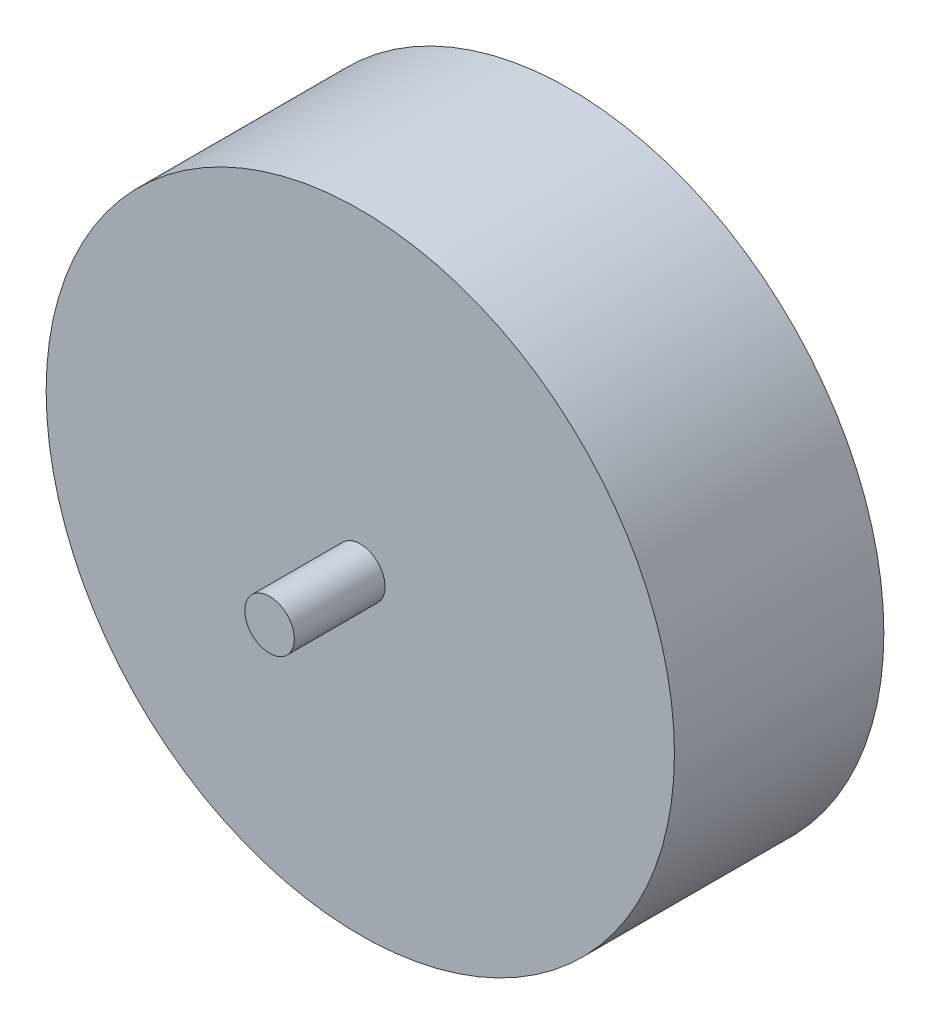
ISO-10303-21;
HEADER;
FILE_DESCRIPTION(('STEP AP214'),'2;1');
FILE_NAME('part.step','',(''),(''),'','','');
FILE_SCHEMA(('AUTOMOTIVE_DESIGN { 1 0 10303 214 1 1 1 1 }'));
ENDSEC;
DATA;
#1=APPLICATION_CONTEXT('core data for automotive mechanical design processes');
#2=APPLICATION_PROTOCOL_DEFINITION('international standard','automotive_design',2000,#1);
#3=PRODUCT_CONTEXT('',#1,'mechanical');
#4=PRODUCT('Part','Part','',(#3));
#5=PRODUCT_RELATED_PRODUCT_CATEGORY('part','',(#4));
#6=PRODUCT_DEFINITION_FORMATION('','',#4);
#7=PRODUCT_DEFINITION_CONTEXT('part definition',#1,'design');
#8=PRODUCT_DEFINITION('design','',#6,#7);
#9=PRODUCT_DEFINITION_SHAPE('','',#8);
#10=(LENGTH_UNIT() NAMED_UNIT(*) SI_UNIT(.MILLI.,.METRE.));
#11=(NAMED_UNIT(*) PLANE_ANGLE_UNIT() SI_UNIT($,.RADIAN.));
#12=(NAMED_UNIT(*) SI_UNIT($,.STERADIAN.) SOLID_ANGLE_UNIT());
#13=UNCERTAINTY_MEASURE_WITH_UNIT(LENGTH_MEASURE(1.E-05),#10,'distance_accuracy_value','');
#14=(GEOMETRIC_REPRESENTATION_CONTEXT(3) GLOBAL_UNCERTAINTY_ASSIGNED_CONTEXT((#13)) GLOBAL_UNIT_ASSIGNED_CONTEXT((#10,
#11,#12)) REPRESENTATION_CONTEXT('',''));
#15=CARTESIAN_POINT('',(0.,0.,0.));
#16=DIRECTION('',(0.,0.,1.));
#17=DIRECTION('',(1.,0.,0.));
#18=AXIS2_PLACEMENT_3D('',#15,#16,#17);
#19=CARTESIAN_POINT('',(0.,0.,25.4));
#20=DIRECTION('',(0.,0.,-1.));
#21=DIRECTION('',(-1.,0.,0.));
#22=AXIS2_PLACEMENT_3D('',#19,#20,#21);
#23=CYLINDRICAL_SURFACE('',#22,38.1);
#24=CARTESIAN_POINT('',(0.,0.,25.4));
#25=DIRECTION('',(0.,0.,1.));
#26=DIRECTION('',(1.,0.,0.));
#27=AXIS2_PLACEMENT_3D('',#24,#25,#26);
#28=CIRCLE('',#27,38.1);
#29=CARTESIAN_POINT('',(38.1,0.,25.4));
#30=VERTEX_POINT('',#29);
#31=EDGE_CURVE('E20',#30,#30,#28,.T.);
#32=ORIENTED_EDGE('',*,*,#31,.F.);
#33=EDGE_LOOP('',(#32));
#34=FACE_BOUND('',#33,.T.);
#35=CARTESIAN_POINT('',(0.,0.,0.));
#36=DIRECTION('',(0.,0.,1.));
#37=DIRECTION('',(1.,0.,0.));
#38=AXIS2_PLACEMENT_3D('',#35,#36,#37);
#39=CIRCLE('',#38,38.1);
#40=CARTESIAN_POINT('',(38.1,0.,0.));
#41=VERTEX_POINT('',#40);
#42=EDGE_CURVE('E25',#41,#41,#39,.T.);
#43=ORIENTED_EDGE('',*,*,#42,.T.);
#44=EDGE_LOOP('',(#43));
#45=FACE_BOUND('',#44,.T.);
#46=ADVANCED_FACE('F13',(#34,#45),#23,.T.);
#47=CARTESIAN_POINT('',(0.,0.,25.4));
#48=DIRECTION('',(0.,0.,1.));
#49=DIRECTION('',(1.,0.,0.));
#50=AXIS2_PLACEMENT_3D('',#47,#48,#49);
#51=PLANE('',#50);
#52=CARTESIAN_POINT('',(0.,0.,25.4));
#53=DIRECTION('',(0.,0.,1.));
#54=DIRECTION('',(1.,0.,0.));
#55=AXIS2_PLACEMENT_3D('',#52,#53,#54);
#56=CIRCLE('',#55,3.);
#57=CARTESIAN_POINT('',(3.,0.,25.4));
#58=VERTEX_POINT('',#57);
#59=EDGE_CURVE('E9',#58,#58,#56,.T.);
#60=ORIENTED_EDGE('',*,*,#59,.F.);
#61=EDGE_LOOP('',(#60));
#62=FACE_BOUND('',#61,.T.);
#63=ORIENTED_EDGE('',*,*,#31,.T.);
#64=EDGE_LOOP('',(#63));
#65=FACE_BOUND('',#64,.T.);
#66=ADVANCED_FACE('F58',(#62,#65),#51,.T.);
#67=CARTESIAN_POINT('',(0.,0.,0.));
#68=DIRECTION('',(0.,0.,1.));
#69=DIRECTION('',(1.,0.,0.));
#70=AXIS2_PLACEMENT_3D('',#67,#68,#69);
#71=PLANE('',#70);
#72=CARTESIAN_POINT('',(0.,0.,0.));
#73=DIRECTION('',(0.,0.,1.));
#74=DIRECTION('',(1.,0.,0.));
#75=AXIS2_PLACEMENT_3D('',#72,#73,#74);
#76=CIRCLE('',#75,3.);
#77=CARTESIAN_POINT('',(3.,0.,0.));
#78=VERTEX_POINT('',#77);
#79=EDGE_CURVE('E16',#78,#78,#76,.T.);
#80=ORIENTED_EDGE('',*,*,#79,.T.);
#81=EDGE_LOOP('',(#80));
#82=FACE_BOUND('',#81,.T.);
#83=ORIENTED_EDGE('',*,*,#42,.F.);
#84=EDGE_LOOP('',(#83));
#85=FACE_BOUND('',#84,.T.);
#86=ADVANCED_FACE('F67',(#82,#85),#71,.F.);
#87=CARTESIAN_POINT('',(0.,0.,-11.));
#88=DIRECTION('',(0.,0.,1.));
#89=DIRECTION('',(1.,0.,0.));
#90=AXIS2_PLACEMENT_3D('',#87,#88,#89);
#91=PLANE('',#90);
#92=CARTESIAN_POINT('',(0.,0.,-11.));
#93=DIRECTION('',(0.,0.,1.));
#94=DIRECTION('',(1.,0.,0.));
#95=AXIS2_PLACEMENT_3D('',#92,#93,#94);
#96=CIRCLE('',#95,3.);
#97=CARTESIAN_POINT('',(3.,0.,-11.));
#98=VERTEX_POINT('',#97);
#99=EDGE_CURVE('E29',#98,#98,#96,.T.);
#100=ORIENTED_EDGE('',*,*,#99,.F.);
#101=EDGE_LOOP('',(#100));
#102=FACE_BOUND('',#101,.T.);
#103=ADVANCED_FACE('F57',(#102),#91,.F.);
#104=CARTESIAN_POINT('',(0.,0.,-11.));
#105=DIRECTION('',(0.,0.,1.));
#106=DIRECTION('',(1.,0.,0.));
#107=AXIS2_PLACEMENT_3D('',#104,#105,#106);
#108=CYLINDRICAL_SURFACE('',#107,3.);
#109=ORIENTED_EDGE('',*,*,#99,.T.);
#110=EDGE_LOOP('',(#109));
#111=FACE_BOUND('',#110,.T.);
#112=ORIENTED_EDGE('',*,*,#79,.F.);
#113=EDGE_LOOP('',(#112));
#114=FACE_BOUND('',#113,.T.);
#115=ADVANCED_FACE('F50',(#111,#114),#108,.T.);
#116=ORIENTED_EDGE('',*,*,#59,.T.);
#117=EDGE_LOOP('',(#116));
#118=FACE_BOUND('',#117,.T.);
#119=CARTESIAN_POINT('',(0.,0.,36.4));
#120=DIRECTION('',(0.,0.,1.));
#121=DIRECTION('',(1.,0.,0.));
#122=AXIS2_PLACEMENT_3D('',#119,#120,#121);
#123=CIRCLE('',#122,3.);
#124=CARTESIAN_POINT('',(3.,0.,36.4));
#125=VERTEX_POINT('',#124);
#126=EDGE_CURVE('E40',#125,#125,#123,.T.);
#127=ORIENTED_EDGE('',*,*,#126,.F.);
#128=EDGE_LOOP('',(#127));
#129=FACE_BOUND('',#128,.T.);
#130=ADVANCED_FACE('F44',(#118,#129),#108,.T.);
#131=CARTESIAN_POINT('',(0.,0.,36.4));
#132=DIRECTION('',(0.,0.,1.));
#133=DIRECTION('',(1.,0.,0.));
#134=AXIS2_PLACEMENT_3D('',#131,#132,#133);
#135=PLANE('',#134);
#136=ORIENTED_EDGE('',*,*,#126,.T.);
#137=EDGE_LOOP('',(#136));
#138=FACE_BOUND('',#137,.T.);
#139=ADVANCED_FACE('F43',(#138),#135,.T.);
#140=CLOSED_SHELL('',(#46,#66,#86,#103,#115,#130,#139));
#141=MANIFOLD_SOLID_BREP('B1',#140);
#142=ADVANCED_BREP_SHAPE_REPRESENTATION('',(#18,#141),#14);
#143=SHAPE_DEFINITION_REPRESENTATION(#9,#142);
ENDSEC;
END-ISO-10303-21;
